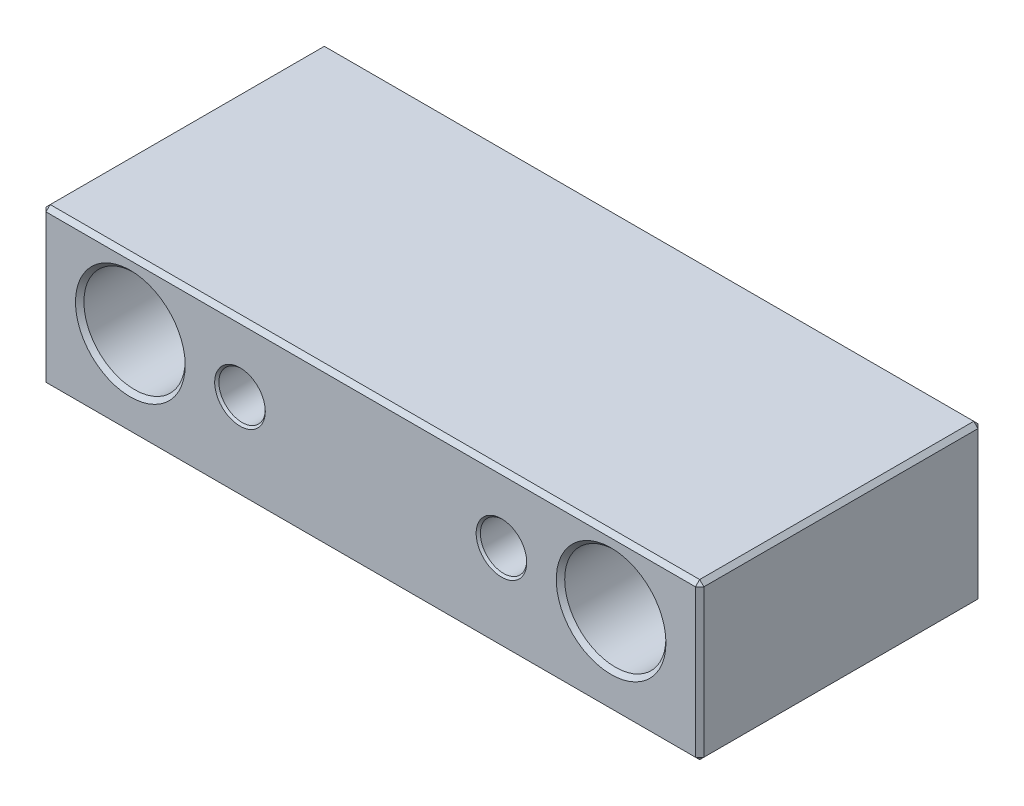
ISO-10303-21;
HEADER;
FILE_DESCRIPTION(('STEP AP214'),'2;1');
FILE_NAME('part.step','',(''),(''),'','','');
FILE_SCHEMA(('AUTOMOTIVE_DESIGN { 1 0 10303 214 1 1 1 1 }'));
ENDSEC;
DATA;
#1=APPLICATION_CONTEXT('core data for automotive mechanical design processes');
#2=APPLICATION_PROTOCOL_DEFINITION('international standard','automotive_design',2000,#1);
#3=PRODUCT_CONTEXT('',#1,'mechanical');
#4=PRODUCT('Part','Part','',(#3));
#5=PRODUCT_RELATED_PRODUCT_CATEGORY('part','',(#4));
#6=PRODUCT_DEFINITION_FORMATION('','',#4);
#7=PRODUCT_DEFINITION_CONTEXT('part definition',#1,'design');
#8=PRODUCT_DEFINITION('design','',#6,#7);
#9=PRODUCT_DEFINITION_SHAPE('','',#8);
#10=(LENGTH_UNIT() NAMED_UNIT(*) SI_UNIT(.MILLI.,.METRE.));
#11=(NAMED_UNIT(*) PLANE_ANGLE_UNIT() SI_UNIT($,.RADIAN.));
#12=(NAMED_UNIT(*) SI_UNIT($,.STERADIAN.) SOLID_ANGLE_UNIT());
#13=UNCERTAINTY_MEASURE_WITH_UNIT(LENGTH_MEASURE(1.E-05),#10,'distance_accuracy_value','');
#14=(GEOMETRIC_REPRESENTATION_CONTEXT(3) GLOBAL_UNCERTAINTY_ASSIGNED_CONTEXT((#13)) GLOBAL_UNIT_ASSIGNED_CONTEXT((#10,
#11,#12)) REPRESENTATION_CONTEXT('',''));
#15=CARTESIAN_POINT('',(0.,0.,0.));
#16=DIRECTION('',(0.,0.,1.));
#17=DIRECTION('',(1.,0.,0.));
#18=AXIS2_PLACEMENT_3D('',#15,#16,#17);
#19=CARTESIAN_POINT('',(155.5,0.499999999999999,66.));
#20=DIRECTION('',(0.577350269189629,-0.577350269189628,0.577350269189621));
#21=DIRECTION('',(0.707106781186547,0.707106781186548,0.));
#22=AXIS2_PLACEMENT_3D('',#19,#20,#21);
#23=PLANE('',#22);
#24=DIRECTION('',(0.707106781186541,0.,-0.707106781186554));
#25=VECTOR('',#24,1.);
#26=CARTESIAN_POINT('',(155.5,1.,66.5));
#27=LINE('',#26,#25);
#28=CARTESIAN_POINT('',(155.,1.,67.));
#29=VERTEX_POINT('',#28);
#30=CARTESIAN_POINT('',(156.,0.999999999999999,66.));
#31=VERTEX_POINT('',#30);
#32=EDGE_CURVE('E227',#29,#31,#27,.T.);
#33=ORIENTED_EDGE('',*,*,#32,.F.);
#34=DIRECTION('',(0.,-0.707106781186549,-0.707106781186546));
#35=VECTOR('',#34,1.);
#36=CARTESIAN_POINT('',(155.,0.5,66.5));
#37=LINE('',#36,#35);
#38=CARTESIAN_POINT('',(155.,0.,66.));
#39=VERTEX_POINT('',#38);
#40=EDGE_CURVE('E103',#39,#29,#37,.F.);
#41=ORIENTED_EDGE('',*,*,#40,.F.);
#42=DIRECTION('',(0.707106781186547,0.707106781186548,0.));
#43=VECTOR('',#42,1.);
#44=CARTESIAN_POINT('',(155.5,0.499999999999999,66.));
#45=LINE('',#44,#43);
#46=EDGE_CURVE('E225',#31,#39,#45,.F.);
#47=ORIENTED_EDGE('',*,*,#46,.F.);
#48=EDGE_LOOP('',(#33,#41,#47));
#49=FACE_BOUND('',#48,.T.);
#50=ADVANCED_FACE('F17',(#49),#23,.T.);
#51=CARTESIAN_POINT('',(155.,0.5,0.5));
#52=DIRECTION('',(0.577350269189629,-0.577350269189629,-0.577350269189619));
#53=DIRECTION('',(0.707106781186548,0.707106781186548,0.));
#54=AXIS2_PLACEMENT_3D('',#51,#52,#53);
#55=PLANE('',#54);
#56=DIRECTION('',(-0.70710678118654,0.,-0.707106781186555));
#57=VECTOR('',#56,1.);
#58=CARTESIAN_POINT('',(155.5,0.999999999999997,0.500000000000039));
#59=LINE('',#58,#57);
#60=CARTESIAN_POINT('',(156.,0.999999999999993,1.));
#61=VERTEX_POINT('',#60);
#62=CARTESIAN_POINT('',(155.,0.999999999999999,0.));
#63=VERTEX_POINT('',#62);
#64=EDGE_CURVE('E208',#61,#63,#59,.T.);
#65=ORIENTED_EDGE('',*,*,#64,.F.);
#66=DIRECTION('',(0.707106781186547,0.707106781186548,0.));
#67=VECTOR('',#66,1.);
#68=CARTESIAN_POINT('',(155.5,0.499999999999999,1.));
#69=LINE('',#68,#67);
#70=CARTESIAN_POINT('',(155.,0.,0.999999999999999));
#71=VERTEX_POINT('',#70);
#72=EDGE_CURVE('E221',#71,#61,#69,.T.);
#73=ORIENTED_EDGE('',*,*,#72,.F.);
#74=DIRECTION('',(0.,0.707106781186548,-0.707106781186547));
#75=VECTOR('',#74,1.);
#76=CARTESIAN_POINT('',(155.,0.5,0.5));
#77=LINE('',#76,#75);
#78=EDGE_CURVE('E218',#63,#71,#77,.F.);
#79=ORIENTED_EDGE('',*,*,#78,.F.);
#80=EDGE_LOOP('',(#65,#73,#79));
#81=FACE_BOUND('',#80,.T.);
#82=ADVANCED_FACE('F474',(#81),#55,.T.);
#83=CARTESIAN_POINT('',(109.,21.,-106.764208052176));
#84=DIRECTION('',(0.,0.,1.));
#85=DIRECTION('',(1.,0.,0.));
#86=AXIS2_PLACEMENT_3D('',#83,#84,#85);
#87=CYLINDRICAL_SURFACE('',#86,5.5);
#88=CARTESIAN_POINT('',(109.,21.,0.50000000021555));
#89=DIRECTION('',(0.,0.,-1.));
#90=DIRECTION('',(1.,0.,0.));
#91=AXIS2_PLACEMENT_3D('',#88,#89,#90);
#92=CIRCLE('',#91,5.50000000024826);
#93=CARTESIAN_POINT('',(114.500000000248,21.,0.50000000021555));
#94=VERTEX_POINT('',#93);
#95=EDGE_CURVE('E203',#94,#94,#92,.T.);
#96=ORIENTED_EDGE('',*,*,#95,.T.);
#97=EDGE_LOOP('',(#96));
#98=FACE_BOUND('',#97,.T.);
#99=CARTESIAN_POINT('',(109.,21.,66.4999999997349));
#100=DIRECTION('',(0.,0.,1.));
#101=DIRECTION('',(-1.,0.,0.));
#102=AXIS2_PLACEMENT_3D('',#99,#100,#101);
#103=CIRCLE('',#102,5.50000000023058);
#104=CARTESIAN_POINT('',(103.499999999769,21.,66.4999999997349));
#105=VERTEX_POINT('',#104);
#106=EDGE_CURVE('E243',#105,#105,#103,.T.);
#107=ORIENTED_EDGE('',*,*,#106,.T.);
#108=EDGE_LOOP('',(#107));
#109=FACE_BOUND('',#108,.T.);
#110=ADVANCED_FACE('F471',(#98,#109),#87,.F.);
#111=CARTESIAN_POINT('',(21.,21.,-106.764208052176));
#112=DIRECTION('',(0.,0.,1.));
#113=DIRECTION('',(1.,0.,0.));
#114=AXIS2_PLACEMENT_3D('',#111,#112,#113);
#115=CYLINDRICAL_SURFACE('',#114,12.00525);
#116=CARTESIAN_POINT('',(21.,21.,1.00000000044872));
#117=DIRECTION('',(0.,0.,-1.));
#118=DIRECTION('',(1.,0.,0.));
#119=AXIS2_PLACEMENT_3D('',#116,#117,#118);
#120=CIRCLE('',#119,12.0052500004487);
#121=CARTESIAN_POINT('',(33.0052500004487,21.,1.00000000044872));
#122=VERTEX_POINT('',#121);
#123=EDGE_CURVE('E198',#122,#122,#120,.T.);
#124=ORIENTED_EDGE('',*,*,#123,.T.);
#125=EDGE_LOOP('',(#124));
#126=FACE_BOUND('',#125,.T.);
#127=CARTESIAN_POINT('',(21.,21.,65.9999999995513));
#128=DIRECTION('',(0.,0.,1.));
#129=DIRECTION('',(-1.,0.,0.));
#130=AXIS2_PLACEMENT_3D('',#127,#128,#129);
#131=CIRCLE('',#130,12.0052500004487);
#132=CARTESIAN_POINT('',(8.99474999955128,21.,65.9999999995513));
#133=VERTEX_POINT('',#132);
#134=EDGE_CURVE('E238',#133,#133,#131,.T.);
#135=ORIENTED_EDGE('',*,*,#134,.T.);
#136=EDGE_LOOP('',(#135));
#137=FACE_BOUND('',#136,.T.);
#138=ADVANCED_FACE('F467',(#126,#137),#115,.F.);
#139=CARTESIAN_POINT('',(135.,21.,-106.764208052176));
#140=DIRECTION('',(0.,0.,1.));
#141=DIRECTION('',(1.,0.,0.));
#142=AXIS2_PLACEMENT_3D('',#139,#140,#141);
#143=CYLINDRICAL_SURFACE('',#142,12.00525);
#144=CARTESIAN_POINT('',(135.,21.,1.00000000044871));
#145=DIRECTION('',(0.,0.,-1.));
#146=DIRECTION('',(1.,0.,0.));
#147=AXIS2_PLACEMENT_3D('',#144,#145,#146);
#148=CIRCLE('',#147,12.0052500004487);
#149=CARTESIAN_POINT('',(147.005250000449,21.,1.00000000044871));
#150=VERTEX_POINT('',#149);
#151=EDGE_CURVE('E193',#150,#150,#148,.T.);
#152=ORIENTED_EDGE('',*,*,#151,.T.);
#153=EDGE_LOOP('',(#152));
#154=FACE_BOUND('',#153,.T.);
#155=CARTESIAN_POINT('',(135.,21.,65.9999999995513));
#156=DIRECTION('',(0.,0.,1.));
#157=DIRECTION('',(-1.,0.,0.));
#158=AXIS2_PLACEMENT_3D('',#155,#156,#157);
#159=CIRCLE('',#158,12.0052500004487);
#160=CARTESIAN_POINT('',(122.994749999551,21.,65.9999999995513));
#161=VERTEX_POINT('',#160);
#162=EDGE_CURVE('E233',#161,#161,#159,.T.);
#163=ORIENTED_EDGE('',*,*,#162,.T.);
#164=EDGE_LOOP('',(#163));
#165=FACE_BOUND('',#164,.T.);
#166=ADVANCED_FACE('F463',(#154,#165),#143,.F.);
#167=CARTESIAN_POINT('',(47.,21.,-106.764208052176));
#168=DIRECTION('',(0.,0.,1.));
#169=DIRECTION('',(1.,0.,0.));
#170=AXIS2_PLACEMENT_3D('',#167,#168,#169);
#171=CYLINDRICAL_SURFACE('',#170,5.5);
#172=CARTESIAN_POINT('',(47.,21.,0.50000000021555));
#173=DIRECTION('',(0.,0.,-1.));
#174=DIRECTION('',(1.,0.,0.));
#175=AXIS2_PLACEMENT_3D('',#172,#173,#174);
#176=CIRCLE('',#175,5.50000000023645);
#177=CARTESIAN_POINT('',(52.5000000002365,21.,0.50000000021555));
#178=VERTEX_POINT('',#177);
#179=EDGE_CURVE('E190',#178,#178,#176,.T.);
#180=ORIENTED_EDGE('',*,*,#179,.T.);
#181=EDGE_LOOP('',(#180));
#182=FACE_BOUND('',#181,.T.);
#183=CARTESIAN_POINT('',(47.,21.,66.4999999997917));
#184=DIRECTION('',(0.,0.,1.));
#185=DIRECTION('',(-1.,0.,0.));
#186=AXIS2_PLACEMENT_3D('',#183,#184,#185);
#187=CIRCLE('',#186,5.50000000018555);
#188=CARTESIAN_POINT('',(41.4999999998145,21.,66.4999999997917));
#189=VERTEX_POINT('',#188);
#190=EDGE_CURVE('E230',#189,#189,#187,.T.);
#191=ORIENTED_EDGE('',*,*,#190,.T.);
#192=EDGE_LOOP('',(#191));
#193=FACE_BOUND('',#192,.T.);
#194=ADVANCED_FACE('F459',(#182,#193),#171,.F.);
#195=CARTESIAN_POINT('',(0.999999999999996,0.5,0.5));
#196=DIRECTION('',(-0.577350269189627,-0.577350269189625,-0.577350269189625));
#197=DIRECTION('',(-0.707106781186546,0.,0.707106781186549));
#198=AXIS2_PLACEMENT_3D('',#195,#196,#197);
#199=PLANE('',#198);
#200=DIRECTION('',(0.707106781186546,-0.707106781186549,0.));
#201=VECTOR('',#200,1.);
#202=CARTESIAN_POINT('',(0.499999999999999,0.5,1.));
#203=LINE('',#202,#201);
#204=CARTESIAN_POINT('',(0.,1.,1.));
#205=VERTEX_POINT('',#204);
#206=CARTESIAN_POINT('',(0.999999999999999,0.,1.));
#207=VERTEX_POINT('',#206);
#208=EDGE_CURVE('E130',#205,#207,#203,.T.);
#209=ORIENTED_EDGE('',*,*,#208,.F.);
#210=DIRECTION('',(-0.707106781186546,0.,0.707106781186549));
#211=VECTOR('',#210,1.);
#212=CARTESIAN_POINT('',(0.500000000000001,1.,0.499999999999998));
#213=LINE('',#212,#211);
#214=CARTESIAN_POINT('',(1.,1.,0.));
#215=VERTEX_POINT('',#214);
#216=EDGE_CURVE('E136',#215,#205,#213,.T.);
#217=ORIENTED_EDGE('',*,*,#216,.F.);
#218=DIRECTION('',(0.,0.707106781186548,-0.707106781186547));
#219=VECTOR('',#218,1.);
#220=CARTESIAN_POINT('',(1.,0.5,0.5));
#221=LINE('',#220,#219);
#222=EDGE_CURVE('E213',#207,#215,#221,.T.);
#223=ORIENTED_EDGE('',*,*,#222,.F.);
#224=EDGE_LOOP('',(#209,#217,#223));
#225=FACE_BOUND('',#224,.T.);
#226=ADVANCED_FACE('F456',(#225),#199,.T.);
#227=CARTESIAN_POINT('',(156.,0.,0.));
#228=DIRECTION('',(0.,-1.,0.));
#229=DIRECTION('',(0.,0.,-1.));
#230=AXIS2_PLACEMENT_3D('',#227,#228,#229);
#231=PLANE('',#230);
#232=DIRECTION('',(0.,0.,1.));
#233=VECTOR('',#232,1.);
#234=CARTESIAN_POINT('',(155.,0.,0.));
#235=LINE('',#234,#233);
#236=EDGE_CURVE('E117',#39,#71,#235,.F.);
#237=ORIENTED_EDGE('',*,*,#236,.F.);
#238=DIRECTION('',(1.,0.,0.));
#239=VECTOR('',#238,1.);
#240=CARTESIAN_POINT('',(117.,0.,66.));
#241=LINE('',#240,#239);
#242=CARTESIAN_POINT('',(0.999999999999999,0.,66.));
#243=VERTEX_POINT('',#242);
#244=EDGE_CURVE('E110',#243,#39,#241,.T.);
#245=ORIENTED_EDGE('',*,*,#244,.F.);
#246=DIRECTION('',(0.,0.,1.));
#247=VECTOR('',#246,1.);
#248=CARTESIAN_POINT('',(0.999999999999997,0.,0.));
#249=LINE('',#248,#247);
#250=EDGE_CURVE('E114',#207,#243,#249,.T.);
#251=ORIENTED_EDGE('',*,*,#250,.F.);
#252=DIRECTION('',(1.,0.,0.));
#253=VECTOR('',#252,1.);
#254=CARTESIAN_POINT('',(117.,0.,1.));
#255=LINE('',#254,#253);
#256=EDGE_CURVE('E216',#71,#207,#255,.F.);
#257=ORIENTED_EDGE('',*,*,#256,.F.);
#258=EDGE_LOOP('',(#237,#245,#251,#257));
#259=FACE_BOUND('',#258,.T.);
#260=ADVANCED_FACE('F112',(#259),#231,.T.);
#261=CARTESIAN_POINT('',(0.499999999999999,0.5,66.));
#262=DIRECTION('',(-0.577350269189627,-0.577350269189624,0.577350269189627));
#263=DIRECTION('',(0.707106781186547,0.,0.707106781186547));
#264=AXIS2_PLACEMENT_3D('',#261,#262,#263);
#265=PLANE('',#264);
#266=DIRECTION('',(0.707106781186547,0.,0.707106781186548));
#267=VECTOR('',#266,1.);
#268=CARTESIAN_POINT('',(0.500000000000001,1.,66.5));
#269=LINE('',#268,#267);
#270=CARTESIAN_POINT('',(0.,1.,66.));
#271=VERTEX_POINT('',#270);
#272=CARTESIAN_POINT('',(1.,1.,67.));
#273=VERTEX_POINT('',#272);
#274=EDGE_CURVE('E131',#271,#273,#269,.T.);
#275=ORIENTED_EDGE('',*,*,#274,.F.);
#276=DIRECTION('',(0.707106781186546,-0.707106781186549,0.));
#277=VECTOR('',#276,1.);
#278=CARTESIAN_POINT('',(0.499999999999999,0.5,66.));
#279=LINE('',#278,#277);
#280=EDGE_CURVE('E128',#243,#271,#279,.F.);
#281=ORIENTED_EDGE('',*,*,#280,.F.);
#282=DIRECTION('',(0.,-0.707106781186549,-0.707106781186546));
#283=VECTOR('',#282,1.);
#284=CARTESIAN_POINT('',(1.,0.5,66.5));
#285=LINE('',#284,#283);
#286=EDGE_CURVE('E120',#273,#243,#285,.T.);
#287=ORIENTED_EDGE('',*,*,#286,.F.);
#288=EDGE_LOOP('',(#275,#281,#287));
#289=FACE_BOUND('',#288,.T.);
#290=ADVANCED_FACE('F134',(#289),#265,.T.);
#291=CARTESIAN_POINT('',(117.,0.5,66.5));
#292=DIRECTION('',(0.,-0.707106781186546,0.707106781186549));
#293=DIRECTION('',(0.,-0.707106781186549,-0.707106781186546));
#294=AXIS2_PLACEMENT_3D('',#291,#292,#293);
#295=PLANE('',#294);
#296=ORIENTED_EDGE('',*,*,#40,.T.);
#297=DIRECTION('',(1.,0.,0.));
#298=VECTOR('',#297,1.);
#299=CARTESIAN_POINT('',(78.,1.,67.));
#300=LINE('',#299,#298);
#301=EDGE_CURVE('E141',#273,#29,#300,.T.);
#302=ORIENTED_EDGE('',*,*,#301,.F.);
#303=ORIENTED_EDGE('',*,*,#286,.T.);
#304=ORIENTED_EDGE('',*,*,#244,.T.);
#305=EDGE_LOOP('',(#296,#302,#303,#304));
#306=FACE_BOUND('',#305,.T.);
#307=ADVANCED_FACE('F139',(#306),#295,.T.);
#308=CARTESIAN_POINT('',(109.,21.,67.0000000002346));
#309=DIRECTION('',(0.,0.,1.));
#310=DIRECTION('',(1.,0.,0.));
#311=AXIS2_PLACEMENT_3D('',#308,#309,#310);
#312=CONICAL_SURFACE('',#311,5.99999999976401,0.78539816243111);
#313=CARTESIAN_POINT('',(109.,21.,67.0000000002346));
#314=DIRECTION('',(0.,0.,1.));
#315=DIRECTION('',(1.,0.,0.));
#316=AXIS2_PLACEMENT_3D('',#313,#314,#315);
#317=CIRCLE('',#316,5.99999999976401);
#318=CARTESIAN_POINT('',(114.999999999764,21.,67.0000000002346));
#319=VERTEX_POINT('',#318);
#320=EDGE_CURVE('E20',#319,#319,#317,.F.);
#321=ORIENTED_EDGE('',*,*,#320,.F.);
#322=EDGE_LOOP('',(#321));
#323=FACE_BOUND('',#322,.T.);
#324=ORIENTED_EDGE('',*,*,#106,.F.);
#325=EDGE_LOOP('',(#324));
#326=FACE_BOUND('',#325,.T.);
#327=ADVANCED_FACE('F445',(#323,#326),#312,.F.);
#328=CARTESIAN_POINT('',(21.,21.,67.0000000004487));
#329=DIRECTION('',(0.,0.,1.));
#330=DIRECTION('',(1.,0.,0.));
#331=AXIS2_PLACEMENT_3D('',#328,#329,#330);
#332=CONICAL_SURFACE('',#331,13.0052499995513,0.785398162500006);
#333=CARTESIAN_POINT('',(21.,21.,67.0000000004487));
#334=DIRECTION('',(0.,0.,1.));
#335=DIRECTION('',(1.,0.,0.));
#336=AXIS2_PLACEMENT_3D('',#333,#334,#335);
#337=CIRCLE('',#336,13.0052499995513);
#338=CARTESIAN_POINT('',(34.0052499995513,21.,67.0000000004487));
#339=VERTEX_POINT('',#338);
#340=EDGE_CURVE('E166',#339,#339,#337,.F.);
#341=ORIENTED_EDGE('',*,*,#340,.F.);
#342=EDGE_LOOP('',(#341));
#343=FACE_BOUND('',#342,.T.);
#344=ORIENTED_EDGE('',*,*,#134,.F.);
#345=EDGE_LOOP('',(#344));
#346=FACE_BOUND('',#345,.T.);
#347=ADVANCED_FACE('F441',(#343,#346),#332,.F.);
#348=CARTESIAN_POINT('',(135.,21.,67.0000000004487));
#349=DIRECTION('',(0.,0.,1.));
#350=DIRECTION('',(1.,0.,0.));
#351=AXIS2_PLACEMENT_3D('',#348,#349,#350);
#352=CONICAL_SURFACE('',#351,13.0052499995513,0.7853981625);
#353=CARTESIAN_POINT('',(135.,21.,67.0000000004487));
#354=DIRECTION('',(0.,0.,1.));
#355=DIRECTION('',(1.,0.,0.));
#356=AXIS2_PLACEMENT_3D('',#353,#354,#355);
#357=CIRCLE('',#356,13.0052499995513);
#358=CARTESIAN_POINT('',(148.005249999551,21.,67.0000000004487));
#359=VERTEX_POINT('',#358);
#360=EDGE_CURVE('E164',#359,#359,#357,.F.);
#361=ORIENTED_EDGE('',*,*,#360,.F.);
#362=EDGE_LOOP('',(#361));
#363=FACE_BOUND('',#362,.T.);
#364=ORIENTED_EDGE('',*,*,#162,.F.);
#365=EDGE_LOOP('',(#364));
#366=FACE_BOUND('',#365,.T.);
#367=ADVANCED_FACE('F437',(#363,#366),#352,.F.);
#368=CARTESIAN_POINT('',(47.,21.,67.0000000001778));
#369=DIRECTION('',(0.,0.,1.));
#370=DIRECTION('',(1.,0.,0.));
#371=AXIS2_PLACEMENT_3D('',#368,#369,#370);
#372=CONICAL_SURFACE('',#371,5.99999999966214,0.785398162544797);
#373=CARTESIAN_POINT('',(47.,21.,67.0000000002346));
#374=DIRECTION('',(0.,0.,1.));
#375=DIRECTION('',(1.,0.,0.));
#376=AXIS2_PLACEMENT_3D('',#373,#374,#375);
#377=CIRCLE('',#376,5.99999999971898);
#378=CARTESIAN_POINT('',(52.999999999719,21.,67.0000000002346));
#379=VERTEX_POINT('',#378);
#380=EDGE_CURVE('E160',#379,#379,#377,.F.);
#381=ORIENTED_EDGE('',*,*,#380,.F.);
#382=EDGE_LOOP('',(#381));
#383=FACE_BOUND('',#382,.T.);
#384=ORIENTED_EDGE('',*,*,#190,.F.);
#385=EDGE_LOOP('',(#384));
#386=FACE_BOUND('',#385,.T.);
#387=ADVANCED_FACE('F434',(#383,#386),#372,.F.);
#388=CARTESIAN_POINT('',(155.5,27.7499999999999,66.5));
#389=DIRECTION('',(0.707106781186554,0.,0.707106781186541));
#390=DIRECTION('',(0.707106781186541,0.,-0.707106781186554));
#391=AXIS2_PLACEMENT_3D('',#388,#389,#390);
#392=PLANE('',#391);
#393=DIRECTION('',(0.707106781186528,0.,-0.707106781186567));
#394=VECTOR('',#393,1.);
#395=CARTESIAN_POINT('',(155.,36.,67.));
#396=LINE('',#395,#394);
#397=CARTESIAN_POINT('',(155.,36.,67.));
#398=VERTEX_POINT('',#397);
#399=CARTESIAN_POINT('',(156.,36.,66.));
#400=VERTEX_POINT('',#399);
#401=EDGE_CURVE('E163',#398,#400,#396,.T.);
#402=ORIENTED_EDGE('',*,*,#401,.F.);
#403=DIRECTION('',(0.,1.,0.));
#404=VECTOR('',#403,1.);
#405=CARTESIAN_POINT('',(155.,18.5,67.));
#406=LINE('',#405,#404);
#407=EDGE_CURVE('E171',#29,#398,#406,.T.);
#408=ORIENTED_EDGE('',*,*,#407,.F.);
#409=ORIENTED_EDGE('',*,*,#32,.T.);
#410=DIRECTION('',(0.,1.,0.));
#411=VECTOR('',#410,1.);
#412=CARTESIAN_POINT('',(156.,37.,66.));
#413=LINE('',#412,#411);
#414=EDGE_CURVE('E289',#400,#31,#413,.F.);
#415=ORIENTED_EDGE('',*,*,#414,.F.);
#416=EDGE_LOOP('',(#402,#408,#409,#415));
#417=FACE_BOUND('',#416,.T.);
#418=ADVANCED_FACE('F250',(#417),#392,.T.);
#419=CARTESIAN_POINT('',(155.5,0.499999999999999,0.));
#420=DIRECTION('',(0.707106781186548,-0.707106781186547,0.));
#421=DIRECTION('',(0.707106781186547,0.707106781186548,0.));
#422=AXIS2_PLACEMENT_3D('',#419,#420,#421);
#423=PLANE('',#422);
#424=ORIENTED_EDGE('',*,*,#72,.T.);
#425=DIRECTION('',(0.,0.,-1.));
#426=VECTOR('',#425,1.);
#427=CARTESIAN_POINT('',(156.,0.999999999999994,0.));
#428=LINE('',#427,#426);
#429=EDGE_CURVE('E287',#31,#61,#428,.T.);
#430=ORIENTED_EDGE('',*,*,#429,.F.);
#431=ORIENTED_EDGE('',*,*,#46,.T.);
#432=ORIENTED_EDGE('',*,*,#236,.T.);
#433=EDGE_LOOP('',(#424,#430,#431,#432));
#434=FACE_BOUND('',#433,.T.);
#435=ADVANCED_FACE('F427',(#434),#423,.T.);
#436=CARTESIAN_POINT('',(117.,0.5,0.5));
#437=DIRECTION('',(0.,-0.707106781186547,-0.707106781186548));
#438=DIRECTION('',(0.,0.707106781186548,-0.707106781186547));
#439=AXIS2_PLACEMENT_3D('',#436,#437,#438);
#440=PLANE('',#439);
#441=ORIENTED_EDGE('',*,*,#222,.T.);
#442=DIRECTION('',(1.,0.,0.));
#443=VECTOR('',#442,1.);
#444=CARTESIAN_POINT('',(78.0000000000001,1.,0.));
#445=LINE('',#444,#443);
#446=EDGE_CURVE('E275',#215,#63,#445,.T.);
#447=ORIENTED_EDGE('',*,*,#446,.T.);
#448=ORIENTED_EDGE('',*,*,#78,.T.);
#449=ORIENTED_EDGE('',*,*,#256,.T.);
#450=EDGE_LOOP('',(#441,#447,#448,#449));
#451=FACE_BOUND('',#450,.T.);
#452=ADVANCED_FACE('F423',(#451),#440,.T.);
#453=CARTESIAN_POINT('',(155.5,27.7499999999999,0.5));
#454=DIRECTION('',(0.707106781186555,0.,-0.70710678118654));
#455=DIRECTION('',(-0.70710678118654,0.,-0.707106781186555));
#456=AXIS2_PLACEMENT_3D('',#453,#454,#455);
#457=PLANE('',#456);
#458=ORIENTED_EDGE('',*,*,#64,.T.);
#459=DIRECTION('',(0.,1.,0.));
#460=VECTOR('',#459,1.);
#461=CARTESIAN_POINT('',(155.,18.5,0.));
#462=LINE('',#461,#460);
#463=CARTESIAN_POINT('',(155.,36.,0.));
#464=VERTEX_POINT('',#463);
#465=EDGE_CURVE('E159',#63,#464,#462,.T.);
#466=ORIENTED_EDGE('',*,*,#465,.T.);
#467=DIRECTION('',(-0.707106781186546,0.,-0.707106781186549));
#468=VECTOR('',#467,1.);
#469=CARTESIAN_POINT('',(155.5,36.,0.5));
#470=LINE('',#469,#468);
#471=CARTESIAN_POINT('',(156.,36.,1.00000000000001));
#472=VERTEX_POINT('',#471);
#473=EDGE_CURVE('E281',#472,#464,#470,.T.);
#474=ORIENTED_EDGE('',*,*,#473,.F.);
#475=DIRECTION('',(0.,1.,0.));
#476=VECTOR('',#475,1.);
#477=CARTESIAN_POINT('',(156.,37.,1.));
#478=LINE('',#477,#476);
#479=EDGE_CURVE('E284',#61,#472,#478,.T.);
#480=ORIENTED_EDGE('',*,*,#479,.F.);
#481=EDGE_LOOP('',(#458,#466,#474,#480));
#482=FACE_BOUND('',#481,.T.);
#483=ADVANCED_FACE('F419',(#482),#457,.T.);
#484=CARTESIAN_POINT('',(109.,21.,-5.6843418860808E-11));
#485=DIRECTION('',(0.,0.,-1.));
#486=DIRECTION('',(-1.,0.,0.));
#487=AXIS2_PLACEMENT_3D('',#484,#485,#486);
#488=CONICAL_SURFACE('',#487,5.99999999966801,0.785398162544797);
#489=CARTESIAN_POINT('',(109.,21.,-2.27373675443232E-10));
#490=DIRECTION('',(0.,0.,-1.));
#491=DIRECTION('',(-1.,0.,0.));
#492=AXIS2_PLACEMENT_3D('',#489,#490,#491);
#493=CIRCLE('',#492,5.99999999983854);
#494=CARTESIAN_POINT('',(103.000000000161,21.,-2.27373675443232E-10));
#495=VERTEX_POINT('',#494);
#496=EDGE_CURVE('E156',#495,#495,#493,.T.);
#497=ORIENTED_EDGE('',*,*,#496,.T.);
#498=EDGE_LOOP('',(#497));
#499=FACE_BOUND('',#498,.T.);
#500=ORIENTED_EDGE('',*,*,#95,.F.);
#501=EDGE_LOOP('',(#500));
#502=FACE_BOUND('',#501,.T.);
#503=ADVANCED_FACE('F415',(#499,#502),#488,.F.);
#504=CARTESIAN_POINT('',(21.,21.,-4.48724174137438E-10));
#505=DIRECTION('',(0.,0.,-1.));
#506=DIRECTION('',(-1.,0.,0.));
#507=AXIS2_PLACEMENT_3D('',#504,#505,#506);
#508=CONICAL_SURFACE('',#507,13.0052499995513,0.785398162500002);
#509=CARTESIAN_POINT('',(21.,21.,-4.48724174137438E-10));
#510=DIRECTION('',(0.,0.,-1.));
#511=DIRECTION('',(-1.,0.,0.));
#512=AXIS2_PLACEMENT_3D('',#509,#510,#511);
#513=CIRCLE('',#512,13.0052499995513);
#514=CARTESIAN_POINT('',(7.99475000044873,21.,-4.48724174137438E-10));
#515=VERTEX_POINT('',#514);
#516=EDGE_CURVE('E153',#515,#515,#513,.T.);
#517=ORIENTED_EDGE('',*,*,#516,.T.);
#518=EDGE_LOOP('',(#517));
#519=FACE_BOUND('',#518,.T.);
#520=ORIENTED_EDGE('',*,*,#123,.F.);
#521=EDGE_LOOP('',(#520));
#522=FACE_BOUND('',#521,.T.);
#523=ADVANCED_FACE('F411',(#519,#522),#508,.F.);
#524=CARTESIAN_POINT('',(135.,21.,-4.48729161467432E-10));
#525=DIRECTION('',(0.,0.,-1.));
#526=DIRECTION('',(0.,1.,0.));
#527=AXIS2_PLACEMENT_3D('',#524,#525,#526);
#528=CONICAL_SURFACE('',#527,13.0052499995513,0.7853981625);
#529=CARTESIAN_POINT('',(135.,21.,-4.48735449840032E-10));
#530=DIRECTION('',(0.,0.,-1.));
#531=DIRECTION('',(0.,1.,0.));
#532=AXIS2_PLACEMENT_3D('',#529,#530,#531);
#533=CIRCLE('',#532,13.0052499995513);
#534=CARTESIAN_POINT('',(135.,34.0052499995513,-4.48735449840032E-10));
#535=VERTEX_POINT('',#534);
#536=EDGE_CURVE('E150',#535,#535,#533,.T.);
#537=ORIENTED_EDGE('',*,*,#536,.T.);
#538=EDGE_LOOP('',(#537));
#539=FACE_BOUND('',#538,.T.);
#540=ORIENTED_EDGE('',*,*,#151,.F.);
#541=EDGE_LOOP('',(#540));
#542=FACE_BOUND('',#541,.T.);
#543=ADVANCED_FACE('F407',(#539,#542),#528,.F.);
#544=CARTESIAN_POINT('',(47.,21.,-3.41060513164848E-10));
#545=DIRECTION('',(0.,0.,-1.));
#546=DIRECTION('',(-1.,0.,0.));
#547=AXIS2_PLACEMENT_3D('',#544,#545,#546);
#548=CONICAL_SURFACE('',#547,5.99999999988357,0.785398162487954);
#549=CARTESIAN_POINT('',(47.,21.,-2.8421709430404E-10));
#550=DIRECTION('',(0.,0.,-1.));
#551=DIRECTION('',(-1.,0.,0.));
#552=AXIS2_PLACEMENT_3D('',#549,#550,#551);
#553=CIRCLE('',#552,5.99999999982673);
#554=CARTESIAN_POINT('',(41.0000000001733,21.,-2.8421709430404E-10));
#555=VERTEX_POINT('',#554);
#556=EDGE_CURVE('E146',#555,#555,#553,.T.);
#557=ORIENTED_EDGE('',*,*,#556,.T.);
#558=EDGE_LOOP('',(#557));
#559=FACE_BOUND('',#558,.T.);
#560=ORIENTED_EDGE('',*,*,#179,.F.);
#561=EDGE_LOOP('',(#560));
#562=FACE_BOUND('',#561,.T.);
#563=ADVANCED_FACE('F404',(#559,#562),#548,.F.);
#564=CARTESIAN_POINT('',(0.500000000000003,9.25000000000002,0.5));
#565=DIRECTION('',(-0.707106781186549,0.,-0.707106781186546));
#566=DIRECTION('',(-0.707106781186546,0.,0.707106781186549));
#567=AXIS2_PLACEMENT_3D('',#564,#565,#566);
#568=PLANE('',#567);
#569=DIRECTION('',(-0.707106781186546,0.,0.707106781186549));
#570=VECTOR('',#569,1.);
#571=CARTESIAN_POINT('',(1.00000000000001,36.,0.));
#572=LINE('',#571,#570);
#573=CARTESIAN_POINT('',(1.00000000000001,36.,0.));
#574=VERTEX_POINT('',#573);
#575=CARTESIAN_POINT('',(0.,36.,1.));
#576=VERTEX_POINT('',#575);
#577=EDGE_CURVE('E268',#574,#576,#572,.T.);
#578=ORIENTED_EDGE('',*,*,#577,.F.);
#579=DIRECTION('',(0.,1.,0.));
#580=VECTOR('',#579,1.);
#581=CARTESIAN_POINT('',(1.00000000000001,18.5,0.));
#582=LINE('',#581,#580);
#583=EDGE_CURVE('E278',#574,#215,#582,.F.);
#584=ORIENTED_EDGE('',*,*,#583,.T.);
#585=ORIENTED_EDGE('',*,*,#216,.T.);
#586=DIRECTION('',(0.,1.,0.));
#587=VECTOR('',#586,1.);
#588=CARTESIAN_POINT('',(0.,0.,1.));
#589=LINE('',#588,#587);
#590=EDGE_CURVE('E270',#576,#205,#589,.F.);
#591=ORIENTED_EDGE('',*,*,#590,.F.);
#592=EDGE_LOOP('',(#578,#584,#585,#591));
#593=FACE_BOUND('',#592,.T.);
#594=ADVANCED_FACE('F330',(#593),#568,.T.);
#595=CARTESIAN_POINT('',(0.499999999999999,0.5,0.));
#596=DIRECTION('',(-0.707106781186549,-0.707106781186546,0.));
#597=DIRECTION('',(0.707106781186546,-0.707106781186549,0.));
#598=AXIS2_PLACEMENT_3D('',#595,#596,#597);
#599=PLANE('',#598);
#600=ORIENTED_EDGE('',*,*,#208,.T.);
#601=ORIENTED_EDGE('',*,*,#250,.T.);
#602=ORIENTED_EDGE('',*,*,#280,.T.);
#603=DIRECTION('',(0.,0.,1.));
#604=VECTOR('',#603,1.);
#605=CARTESIAN_POINT('',(0.,1.,0.));
#606=LINE('',#605,#604);
#607=EDGE_CURVE('E321',#205,#271,#606,.T.);
#608=ORIENTED_EDGE('',*,*,#607,.F.);
#609=EDGE_LOOP('',(#600,#601,#602,#608));
#610=FACE_BOUND('',#609,.T.);
#611=ADVANCED_FACE('F126',(#610),#599,.T.);
#612=CARTESIAN_POINT('',(0.500000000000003,9.25000000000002,66.5));
#613=DIRECTION('',(-0.707106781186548,0.,0.707106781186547));
#614=DIRECTION('',(0.707106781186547,0.,0.707106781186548));
#615=AXIS2_PLACEMENT_3D('',#612,#613,#614);
#616=PLANE('',#615);
#617=ORIENTED_EDGE('',*,*,#274,.T.);
#618=DIRECTION('',(0.,1.,0.));
#619=VECTOR('',#618,1.);
#620=CARTESIAN_POINT('',(1.00000000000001,18.5,67.));
#621=LINE('',#620,#619);
#622=CARTESIAN_POINT('',(1.00000000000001,36.,67.));
#623=VERTEX_POINT('',#622);
#624=EDGE_CURVE('E180',#623,#273,#621,.F.);
#625=ORIENTED_EDGE('',*,*,#624,.F.);
#626=DIRECTION('',(0.707106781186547,0.,0.707106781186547));
#627=VECTOR('',#626,1.);
#628=CARTESIAN_POINT('',(0.250000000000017,36.,66.25));
#629=LINE('',#628,#627);
#630=CARTESIAN_POINT('',(0.,36.,66.));
#631=VERTEX_POINT('',#630);
#632=EDGE_CURVE('E149',#631,#623,#629,.T.);
#633=ORIENTED_EDGE('',*,*,#632,.F.);
#634=DIRECTION('',(0.,1.,0.));
#635=VECTOR('',#634,1.);
#636=CARTESIAN_POINT('',(0.,0.,66.));
#637=LINE('',#636,#635);
#638=EDGE_CURVE('E319',#271,#631,#637,.T.);
#639=ORIENTED_EDGE('',*,*,#638,.F.);
#640=EDGE_LOOP('',(#617,#625,#633,#639));
#641=FACE_BOUND('',#640,.T.);
#642=ADVANCED_FACE('F259',(#641),#616,.T.);
#643=CARTESIAN_POINT('',(78.,18.5,67.));
#644=DIRECTION('',(0.,0.,1.));
#645=DIRECTION('',(1.,0.,0.));
#646=AXIS2_PLACEMENT_3D('',#643,#644,#645);
#647=PLANE('',#646);
#648=ORIENTED_EDGE('',*,*,#380,.T.);
#649=EDGE_LOOP('',(#648));
#650=FACE_BOUND('',#649,.T.);
#651=ORIENTED_EDGE('',*,*,#360,.T.);
#652=EDGE_LOOP('',(#651));
#653=FACE_BOUND('',#652,.T.);
#654=ORIENTED_EDGE('',*,*,#340,.T.);
#655=EDGE_LOOP('',(#654));
#656=FACE_BOUND('',#655,.T.);
#657=ORIENTED_EDGE('',*,*,#320,.T.);
#658=EDGE_LOOP('',(#657));
#659=FACE_BOUND('',#658,.T.);
#660=ORIENTED_EDGE('',*,*,#301,.T.);
#661=ORIENTED_EDGE('',*,*,#407,.T.);
#662=DIRECTION('',(1.,0.,0.));
#663=VECTOR('',#662,1.);
#664=CARTESIAN_POINT('',(39.,36.,67.));
#665=LINE('',#664,#663);
#666=EDGE_CURVE('E255',#623,#398,#665,.T.);
#667=ORIENTED_EDGE('',*,*,#666,.F.);
#668=ORIENTED_EDGE('',*,*,#624,.T.);
#669=EDGE_LOOP('',(#660,#661,#667,#668));
#670=FACE_BOUND('',#669,.T.);
#671=ADVANCED_FACE('F254',(#650,#653,#656,#659,#670),#647,.T.);
#672=CARTESIAN_POINT('',(155.5,36.5,66.));
#673=DIRECTION('',(0.57735026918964,0.577350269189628,0.57735026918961));
#674=DIRECTION('',(-0.70710678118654,0.707106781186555,0.));
#675=AXIS2_PLACEMENT_3D('',#672,#673,#674);
#676=PLANE('',#675);
#677=DIRECTION('',(0.,-0.707106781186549,0.707106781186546));
#678=VECTOR('',#677,1.);
#679=CARTESIAN_POINT('',(155.,36.5,66.5));
#680=LINE('',#679,#678);
#681=CARTESIAN_POINT('',(155.,37.,66.));
#682=VERTEX_POINT('',#681);
#683=EDGE_CURVE('E298',#398,#682,#680,.F.);
#684=ORIENTED_EDGE('',*,*,#683,.F.);
#685=ORIENTED_EDGE('',*,*,#401,.T.);
#686=DIRECTION('',(-0.707106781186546,0.707106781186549,0.));
#687=VECTOR('',#686,1.);
#688=CARTESIAN_POINT('',(155.5,36.5,66.));
#689=LINE('',#688,#687);
#690=EDGE_CURVE('E296',#682,#400,#689,.F.);
#691=ORIENTED_EDGE('',*,*,#690,.F.);
#692=EDGE_LOOP('',(#684,#685,#691));
#693=FACE_BOUND('',#692,.T.);
#694=ADVANCED_FACE('F294',(#693),#676,.T.);
#695=CARTESIAN_POINT('',(156.,37.,0.));
#696=DIRECTION('',(1.,0.,0.));
#697=DIRECTION('',(0.,0.,-1.));
#698=AXIS2_PLACEMENT_3D('',#695,#696,#697);
#699=PLANE('',#698);
#700=ORIENTED_EDGE('',*,*,#429,.T.);
#701=ORIENTED_EDGE('',*,*,#479,.T.);
#702=DIRECTION('',(0.,0.,1.));
#703=VECTOR('',#702,1.);
#704=CARTESIAN_POINT('',(156.,36.,0.));
#705=LINE('',#704,#703);
#706=EDGE_CURVE('E300',#400,#472,#705,.F.);
#707=ORIENTED_EDGE('',*,*,#706,.F.);
#708=ORIENTED_EDGE('',*,*,#414,.T.);
#709=EDGE_LOOP('',(#700,#701,#707,#708));
#710=FACE_BOUND('',#709,.T.);
#711=ADVANCED_FACE('F301',(#710),#699,.T.);
#712=CARTESIAN_POINT('',(155.5,36.,0.5));
#713=DIRECTION('',(0.577350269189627,0.577350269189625,-0.577350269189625));
#714=DIRECTION('',(-0.707106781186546,0.,-0.707106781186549));
#715=AXIS2_PLACEMENT_3D('',#712,#713,#714);
#716=PLANE('',#715);
#717=DIRECTION('',(-0.707106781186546,0.707106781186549,0.));
#718=VECTOR('',#717,1.);
#719=CARTESIAN_POINT('',(155.5,36.5,1.));
#720=LINE('',#719,#718);
#721=CARTESIAN_POINT('',(155.,37.,1.));
#722=VERTEX_POINT('',#721);
#723=EDGE_CURVE('E306',#472,#722,#720,.T.);
#724=ORIENTED_EDGE('',*,*,#723,.F.);
#725=ORIENTED_EDGE('',*,*,#473,.T.);
#726=DIRECTION('',(0.,0.707106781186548,0.707106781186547));
#727=VECTOR('',#726,1.);
#728=CARTESIAN_POINT('',(155.,36.5,0.500000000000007));
#729=LINE('',#728,#727);
#730=EDGE_CURVE('E338',#722,#464,#729,.F.);
#731=ORIENTED_EDGE('',*,*,#730,.F.);
#732=EDGE_LOOP('',(#724,#725,#731));
#733=FACE_BOUND('',#732,.T.);
#734=ADVANCED_FACE('F387',(#733),#716,.T.);
#735=CARTESIAN_POINT('',(78.0000000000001,18.5,0.));
#736=DIRECTION('',(0.,0.,1.));
#737=DIRECTION('',(1.,0.,0.));
#738=AXIS2_PLACEMENT_3D('',#735,#736,#737);
#739=PLANE('',#738);
#740=ORIENTED_EDGE('',*,*,#556,.F.);
#741=EDGE_LOOP('',(#740));
#742=FACE_BOUND('',#741,.T.);
#743=ORIENTED_EDGE('',*,*,#536,.F.);
#744=EDGE_LOOP('',(#743));
#745=FACE_BOUND('',#744,.T.);
#746=ORIENTED_EDGE('',*,*,#516,.F.);
#747=EDGE_LOOP('',(#746));
#748=FACE_BOUND('',#747,.T.);
#749=ORIENTED_EDGE('',*,*,#496,.F.);
#750=EDGE_LOOP('',(#749));
#751=FACE_BOUND('',#750,.T.);
#752=ORIENTED_EDGE('',*,*,#465,.F.);
#753=ORIENTED_EDGE('',*,*,#446,.F.);
#754=ORIENTED_EDGE('',*,*,#583,.F.);
#755=DIRECTION('',(1.,0.,0.));
#756=VECTOR('',#755,1.);
#757=CARTESIAN_POINT('',(39.,36.,0.));
#758=LINE('',#757,#756);
#759=EDGE_CURVE('E345',#464,#574,#758,.F.);
#760=ORIENTED_EDGE('',*,*,#759,.F.);
#761=EDGE_LOOP('',(#752,#753,#754,#760));
#762=FACE_BOUND('',#761,.T.);
#763=ADVANCED_FACE('F344',(#742,#745,#748,#751,#762),#739,.F.);
#764=CARTESIAN_POINT('',(0.500000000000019,36.5,66.));
#765=DIRECTION('',(-0.577350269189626,0.577350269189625,0.577350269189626));
#766=DIRECTION('',(0.707106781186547,0.,0.707106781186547));
#767=AXIS2_PLACEMENT_3D('',#764,#765,#766);
#768=PLANE('',#767);
#769=DIRECTION('',(0.,-0.707106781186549,0.707106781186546));
#770=VECTOR('',#769,1.);
#771=CARTESIAN_POINT('',(1.00000000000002,36.5,66.5));
#772=LINE('',#771,#770);
#773=CARTESIAN_POINT('',(1.00000000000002,37.,66.));
#774=VERTEX_POINT('',#773);
#775=EDGE_CURVE('E263',#774,#623,#772,.T.);
#776=ORIENTED_EDGE('',*,*,#775,.F.);
#777=DIRECTION('',(-0.707106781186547,-0.707106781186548,0.));
#778=VECTOR('',#777,1.);
#779=CARTESIAN_POINT('',(0.50000000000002,36.5,66.));
#780=LINE('',#779,#778);
#781=EDGE_CURVE('E266',#631,#774,#780,.F.);
#782=ORIENTED_EDGE('',*,*,#781,.F.);
#783=ORIENTED_EDGE('',*,*,#632,.T.);
#784=EDGE_LOOP('',(#776,#782,#783));
#785=FACE_BOUND('',#784,.T.);
#786=ADVANCED_FACE('F262',(#785),#768,.T.);
#787=CARTESIAN_POINT('',(1.00000000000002,36.5,0.5));
#788=DIRECTION('',(-0.577350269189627,0.577350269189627,-0.577350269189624));
#789=DIRECTION('',(-0.707106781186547,-0.707106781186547,0.));
#790=AXIS2_PLACEMENT_3D('',#787,#788,#789);
#791=PLANE('',#790);
#792=DIRECTION('',(-0.707106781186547,-0.707106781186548,0.));
#793=VECTOR('',#792,1.);
#794=CARTESIAN_POINT('',(0.50000000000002,36.5,1.));
#795=LINE('',#794,#793);
#796=CARTESIAN_POINT('',(1.00000000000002,37.,0.999999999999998));
#797=VERTEX_POINT('',#796);
#798=EDGE_CURVE('E35',#797,#576,#795,.T.);
#799=ORIENTED_EDGE('',*,*,#798,.F.);
#800=DIRECTION('',(0.,0.707106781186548,0.707106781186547));
#801=VECTOR('',#800,1.);
#802=CARTESIAN_POINT('',(1.00000000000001,36.5,0.499999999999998));
#803=LINE('',#802,#801);
#804=EDGE_CURVE('E332',#574,#797,#803,.T.);
#805=ORIENTED_EDGE('',*,*,#804,.F.);
#806=ORIENTED_EDGE('',*,*,#577,.T.);
#807=EDGE_LOOP('',(#799,#805,#806));
#808=FACE_BOUND('',#807,.T.);
#809=ADVANCED_FACE('F331',(#808),#791,.T.);
#810=CARTESIAN_POINT('',(0.,0.,0.));
#811=DIRECTION('',(-1.,0.,0.));
#812=DIRECTION('',(0.,0.,1.));
#813=AXIS2_PLACEMENT_3D('',#810,#811,#812);
#814=PLANE('',#813);
#815=ORIENTED_EDGE('',*,*,#607,.T.);
#816=ORIENTED_EDGE('',*,*,#638,.T.);
#817=DIRECTION('',(0.,0.,1.));
#818=VECTOR('',#817,1.);
#819=CARTESIAN_POINT('',(0.,36.,0.));
#820=LINE('',#819,#818);
#821=EDGE_CURVE('E328',#576,#631,#820,.T.);
#822=ORIENTED_EDGE('',*,*,#821,.F.);
#823=ORIENTED_EDGE('',*,*,#590,.T.);
#824=EDGE_LOOP('',(#815,#816,#822,#823));
#825=FACE_BOUND('',#824,.T.);
#826=ADVANCED_FACE('F326',(#825),#814,.T.);
#827=CARTESIAN_POINT('',(39.,36.5,66.5));
#828=DIRECTION('',(0.,0.707106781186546,0.707106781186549));
#829=DIRECTION('',(0.,-0.707106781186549,0.707106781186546));
#830=AXIS2_PLACEMENT_3D('',#827,#828,#829);
#831=PLANE('',#830);
#832=ORIENTED_EDGE('',*,*,#775,.T.);
#833=ORIENTED_EDGE('',*,*,#666,.T.);
#834=ORIENTED_EDGE('',*,*,#683,.T.);
#835=DIRECTION('',(1.,0.,0.));
#836=VECTOR('',#835,1.);
#837=CARTESIAN_POINT('',(0.,37.,66.));
#838=LINE('',#837,#836);
#839=EDGE_CURVE('E357',#774,#682,#838,.T.);
#840=ORIENTED_EDGE('',*,*,#839,.F.);
#841=EDGE_LOOP('',(#832,#833,#834,#840));
#842=FACE_BOUND('',#841,.T.);
#843=ADVANCED_FACE('F375',(#842),#831,.T.);
#844=CARTESIAN_POINT('',(155.5,36.5,0.));
#845=DIRECTION('',(0.707106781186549,0.707106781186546,0.));
#846=DIRECTION('',(-0.707106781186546,0.707106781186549,0.));
#847=AXIS2_PLACEMENT_3D('',#844,#845,#846);
#848=PLANE('',#847);
#849=ORIENTED_EDGE('',*,*,#723,.T.);
#850=DIRECTION('',(0.,0.,1.));
#851=VECTOR('',#850,1.);
#852=CARTESIAN_POINT('',(155.,37.,0.));
#853=LINE('',#852,#851);
#854=EDGE_CURVE('E311',#682,#722,#853,.F.);
#855=ORIENTED_EDGE('',*,*,#854,.F.);
#856=ORIENTED_EDGE('',*,*,#690,.T.);
#857=ORIENTED_EDGE('',*,*,#706,.T.);
#858=EDGE_LOOP('',(#849,#855,#856,#857));
#859=FACE_BOUND('',#858,.T.);
#860=ADVANCED_FACE('F309',(#859),#848,.T.);
#861=CARTESIAN_POINT('',(39.,36.5,0.5));
#862=DIRECTION('',(0.,0.707106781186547,-0.707106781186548));
#863=DIRECTION('',(0.,0.707106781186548,0.707106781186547));
#864=AXIS2_PLACEMENT_3D('',#861,#862,#863);
#865=PLANE('',#864);
#866=ORIENTED_EDGE('',*,*,#730,.T.);
#867=ORIENTED_EDGE('',*,*,#759,.T.);
#868=ORIENTED_EDGE('',*,*,#804,.T.);
#869=DIRECTION('',(1.,0.,0.));
#870=VECTOR('',#869,1.);
#871=CARTESIAN_POINT('',(0.,37.,1.));
#872=LINE('',#871,#870);
#873=EDGE_CURVE('E26',#722,#797,#872,.F.);
#874=ORIENTED_EDGE('',*,*,#873,.F.);
#875=EDGE_LOOP('',(#866,#867,#868,#874));
#876=FACE_BOUND('',#875,.T.);
#877=ADVANCED_FACE('F347',(#876),#865,.T.);
#878=CARTESIAN_POINT('',(0.50000000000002,36.5,0.));
#879=DIRECTION('',(-0.707106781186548,0.707106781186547,0.));
#880=DIRECTION('',(-0.707106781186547,-0.707106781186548,0.));
#881=AXIS2_PLACEMENT_3D('',#878,#879,#880);
#882=PLANE('',#881);
#883=ORIENTED_EDGE('',*,*,#798,.T.);
#884=ORIENTED_EDGE('',*,*,#821,.T.);
#885=ORIENTED_EDGE('',*,*,#781,.T.);
#886=DIRECTION('',(0.,0.,1.));
#887=VECTOR('',#886,1.);
#888=CARTESIAN_POINT('',(1.00000000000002,37.,0.));
#889=LINE('',#888,#887);
#890=EDGE_CURVE('E11',#797,#774,#889,.T.);
#891=ORIENTED_EDGE('',*,*,#890,.F.);
#892=EDGE_LOOP('',(#883,#884,#885,#891));
#893=FACE_BOUND('',#892,.T.);
#894=ADVANCED_FACE('F362',(#893),#882,.T.);
#895=CARTESIAN_POINT('',(0.,37.,0.));
#896=DIRECTION('',(0.,1.,0.));
#897=DIRECTION('',(0.,0.,1.));
#898=AXIS2_PLACEMENT_3D('',#895,#896,#897);
#899=PLANE('',#898);
#900=ORIENTED_EDGE('',*,*,#873,.T.);
#901=ORIENTED_EDGE('',*,*,#890,.T.);
#902=ORIENTED_EDGE('',*,*,#839,.T.);
#903=ORIENTED_EDGE('',*,*,#854,.T.);
#904=EDGE_LOOP('',(#900,#901,#902,#903));
#905=FACE_BOUND('',#904,.T.);
#906=ADVANCED_FACE('F356',(#905),#899,.T.);
#907=CLOSED_SHELL('',(#50,#82,#110,#138,#166,#194,#226,#260,#290,#307,#327,#347,#367,#387,#418,
#435,#452,#483,#503,#523,#543,#563,#594,#611,#642,#671,#694,#711,#734,#763,#786,#809,#826,#843,
#860,#877,#894,#906));
#908=MANIFOLD_SOLID_BREP('B1',#907);
#909=ADVANCED_BREP_SHAPE_REPRESENTATION('',(#18,#908),#14);
#910=SHAPE_DEFINITION_REPRESENTATION(#9,#909);
ENDSEC;
END-ISO-10303-21;
